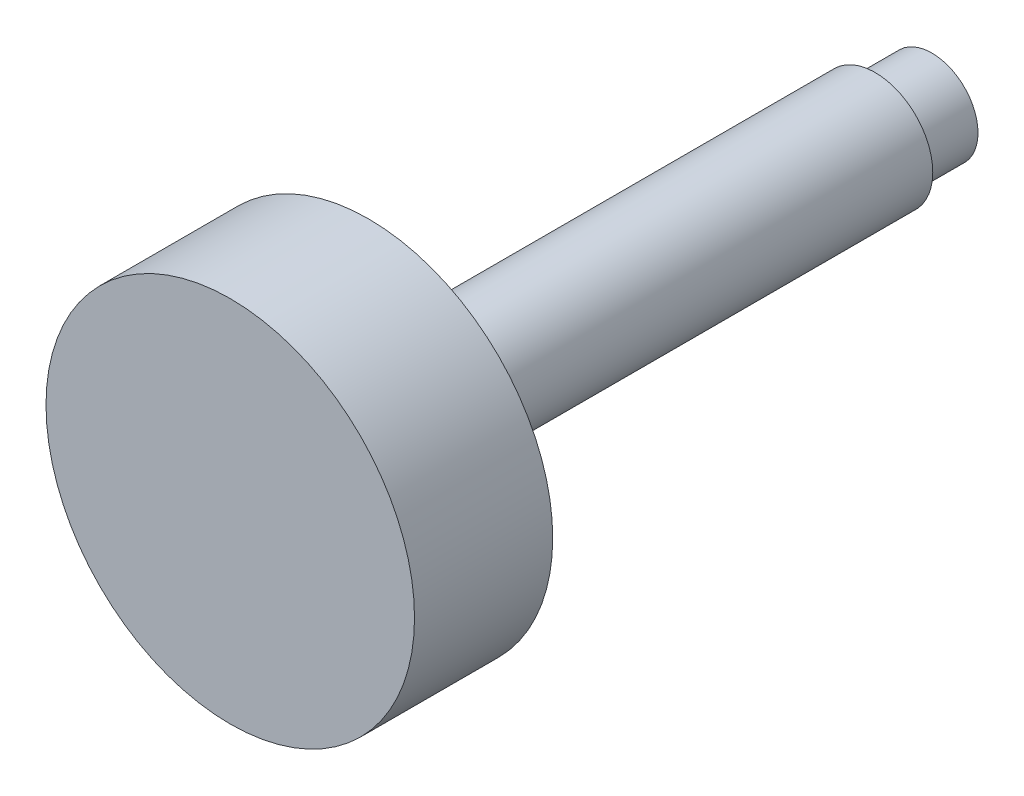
ISO-10303-21;
HEADER;
FILE_DESCRIPTION(('STEP AP214'),'2;1');
FILE_NAME('part.step','',(''),(''),'','','');
FILE_SCHEMA(('AUTOMOTIVE_DESIGN { 1 0 10303 214 1 1 1 1 }'));
ENDSEC;
DATA;
#1=APPLICATION_CONTEXT('core data for automotive mechanical design processes');
#2=APPLICATION_PROTOCOL_DEFINITION('international standard','automotive_design',2000,#1);
#3=PRODUCT_CONTEXT('',#1,'mechanical');
#4=PRODUCT('Part','Part','',(#3));
#5=PRODUCT_RELATED_PRODUCT_CATEGORY('part','',(#4));
#6=PRODUCT_DEFINITION_FORMATION('','',#4);
#7=PRODUCT_DEFINITION_CONTEXT('part definition',#1,'design');
#8=PRODUCT_DEFINITION('design','',#6,#7);
#9=PRODUCT_DEFINITION_SHAPE('','',#8);
#10=(LENGTH_UNIT() NAMED_UNIT(*) SI_UNIT(.MILLI.,.METRE.));
#11=(NAMED_UNIT(*) PLANE_ANGLE_UNIT() SI_UNIT($,.RADIAN.));
#12=(NAMED_UNIT(*) SI_UNIT($,.STERADIAN.) SOLID_ANGLE_UNIT());
#13=UNCERTAINTY_MEASURE_WITH_UNIT(LENGTH_MEASURE(1.E-05),#10,'distance_accuracy_value','');
#14=(GEOMETRIC_REPRESENTATION_CONTEXT(3) GLOBAL_UNCERTAINTY_ASSIGNED_CONTEXT((#13)) GLOBAL_UNIT_ASSIGNED_CONTEXT((#10,
#11,#12)) REPRESENTATION_CONTEXT('',''));
#15=CARTESIAN_POINT('',(0.,0.,0.));
#16=DIRECTION('',(0.,0.,1.));
#17=DIRECTION('',(1.,0.,0.));
#18=AXIS2_PLACEMENT_3D('',#15,#16,#17);
#19=CARTESIAN_POINT('',(0.,0.,4.));
#20=DIRECTION('',(0.,0.,1.));
#21=DIRECTION('',(1.,0.,0.));
#22=AXIS2_PLACEMENT_3D('',#19,#20,#21);
#23=SPHERICAL_SURFACE('',#22,4.);
#24=CARTESIAN_POINT('',(0.,0.,0.535898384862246));
#25=DIRECTION('',(0.,0.,1.));
#26=DIRECTION('',(1.,0.,0.));
#27=AXIS2_PLACEMENT_3D('',#24,#25,#26);
#28=CIRCLE('',#27,2.);
#29=CARTESIAN_POINT('',(2.,0.,0.535898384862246));
#30=VERTEX_POINT('',#29);
#31=EDGE_CURVE('E8',#30,#30,#28,.T.);
#32=ORIENTED_EDGE('',*,*,#31,.F.);
#33=EDGE_LOOP('',(#32));
#34=FACE_BOUND('',#33,.T.);
#35=ADVANCED_FACE('F12',(#34),#23,.T.);
#36=CARTESIAN_POINT('',(0.,0.,40.017563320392));
#37=DIRECTION('',(0.,0.,1.));
#38=DIRECTION('',(1.,0.,0.));
#39=AXIS2_PLACEMENT_3D('',#36,#37,#38);
#40=CYLINDRICAL_SURFACE('',#39,2.);
#41=CARTESIAN_POINT('',(0.,0.,3.));
#42=DIRECTION('',(0.,0.,1.));
#43=DIRECTION('',(1.,0.,0.));
#44=AXIS2_PLACEMENT_3D('',#41,#42,#43);
#45=CIRCLE('',#44,2.);
#46=CARTESIAN_POINT('',(2.,0.,3.));
#47=VERTEX_POINT('',#46);
#48=EDGE_CURVE('E18',#47,#47,#45,.T.);
#49=ORIENTED_EDGE('',*,*,#48,.F.);
#50=EDGE_LOOP('',(#49));
#51=FACE_BOUND('',#50,.T.);
#52=ORIENTED_EDGE('',*,*,#31,.T.);
#53=EDGE_LOOP('',(#52));
#54=FACE_BOUND('',#53,.T.);
#55=ADVANCED_FACE('F60',(#51,#54),#40,.T.);
#56=CARTESIAN_POINT('',(-2.,0.,3.));
#57=DIRECTION('',(0.,0.,1.));
#58=DIRECTION('',(1.,0.,0.));
#59=AXIS2_PLACEMENT_3D('',#56,#57,#58);
#60=PLANE('',#59);
#61=CARTESIAN_POINT('',(0.,0.,3.));
#62=DIRECTION('',(0.,0.,1.));
#63=DIRECTION('',(1.,0.,0.));
#64=AXIS2_PLACEMENT_3D('',#61,#62,#63);
#65=CIRCLE('',#64,2.5);
#66=CARTESIAN_POINT('',(2.5,0.,3.));
#67=VERTEX_POINT('',#66);
#68=EDGE_CURVE('E22',#67,#67,#65,.T.);
#69=ORIENTED_EDGE('',*,*,#68,.F.);
#70=EDGE_LOOP('',(#69));
#71=FACE_BOUND('',#70,.T.);
#72=ORIENTED_EDGE('',*,*,#48,.T.);
#73=EDGE_LOOP('',(#72));
#74=FACE_BOUND('',#73,.T.);
#75=ADVANCED_FACE('F55',(#71,#74),#60,.F.);
#76=CARTESIAN_POINT('',(0.,0.,40.017563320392));
#77=DIRECTION('',(0.,0.,1.));
#78=DIRECTION('',(1.,0.,0.));
#79=AXIS2_PLACEMENT_3D('',#76,#77,#78);
#80=CYLINDRICAL_SURFACE('',#79,2.5);
#81=CARTESIAN_POINT('',(0.,0.,25.));
#82=DIRECTION('',(0.,0.,1.));
#83=DIRECTION('',(1.,0.,0.));
#84=AXIS2_PLACEMENT_3D('',#81,#82,#83);
#85=CIRCLE('',#84,2.5);
#86=CARTESIAN_POINT('',(2.5,0.,25.));
#87=VERTEX_POINT('',#86);
#88=EDGE_CURVE('E26',#87,#87,#85,.T.);
#89=ORIENTED_EDGE('',*,*,#88,.F.);
#90=EDGE_LOOP('',(#89));
#91=FACE_BOUND('',#90,.T.);
#92=ORIENTED_EDGE('',*,*,#68,.T.);
#93=EDGE_LOOP('',(#92));
#94=FACE_BOUND('',#93,.T.);
#95=ADVANCED_FACE('F49',(#91,#94),#80,.T.);
#96=CARTESIAN_POINT('',(-2.5,0.,25.));
#97=DIRECTION('',(0.,0.,1.));
#98=DIRECTION('',(1.,0.,0.));
#99=AXIS2_PLACEMENT_3D('',#96,#97,#98);
#100=PLANE('',#99);
#101=CARTESIAN_POINT('',(0.,0.,25.));
#102=DIRECTION('',(0.,0.,1.));
#103=DIRECTION('',(1.,0.,0.));
#104=AXIS2_PLACEMENT_3D('',#101,#102,#103);
#105=CIRCLE('',#104,8.);
#106=CARTESIAN_POINT('',(8.,0.,25.));
#107=VERTEX_POINT('',#106);
#108=EDGE_CURVE('E31',#107,#107,#105,.T.);
#109=ORIENTED_EDGE('',*,*,#108,.F.);
#110=EDGE_LOOP('',(#109));
#111=FACE_BOUND('',#110,.T.);
#112=ORIENTED_EDGE('',*,*,#88,.T.);
#113=EDGE_LOOP('',(#112));
#114=FACE_BOUND('',#113,.T.);
#115=ADVANCED_FACE('F43',(#111,#114),#100,.F.);
#116=CARTESIAN_POINT('',(0.,0.,40.017563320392));
#117=DIRECTION('',(0.,0.,1.));
#118=DIRECTION('',(1.,0.,0.));
#119=AXIS2_PLACEMENT_3D('',#116,#117,#118);
#120=CYLINDRICAL_SURFACE('',#119,8.);
#121=CARTESIAN_POINT('',(0.,0.,31.));
#122=DIRECTION('',(0.,0.,1.));
#123=DIRECTION('',(1.,0.,0.));
#124=AXIS2_PLACEMENT_3D('',#121,#122,#123);
#125=CIRCLE('',#124,8.);
#126=CARTESIAN_POINT('',(8.,0.,31.));
#127=VERTEX_POINT('',#126);
#128=EDGE_CURVE('E34',#127,#127,#125,.T.);
#129=ORIENTED_EDGE('',*,*,#128,.F.);
#130=EDGE_LOOP('',(#129));
#131=FACE_BOUND('',#130,.T.);
#132=ORIENTED_EDGE('',*,*,#108,.T.);
#133=EDGE_LOOP('',(#132));
#134=FACE_BOUND('',#133,.T.);
#135=ADVANCED_FACE('F40',(#131,#134),#120,.T.);
#136=CARTESIAN_POINT('',(-8.,0.,31.));
#137=DIRECTION('',(0.,0.,-1.));
#138=DIRECTION('',(-1.,0.,0.));
#139=AXIS2_PLACEMENT_3D('',#136,#137,#138);
#140=PLANE('',#139);
#141=ORIENTED_EDGE('',*,*,#128,.T.);
#142=EDGE_LOOP('',(#141));
#143=FACE_BOUND('',#142,.T.);
#144=ADVANCED_FACE('F38',(#143),#140,.F.);
#145=CLOSED_SHELL('',(#35,#55,#75,#95,#115,#135,#144));
#146=MANIFOLD_SOLID_BREP('B1',#145);
#147=ADVANCED_BREP_SHAPE_REPRESENTATION('',(#18,#146),#14);
#148=SHAPE_DEFINITION_REPRESENTATION(#9,#147);
ENDSEC;
END-ISO-10303-21;
